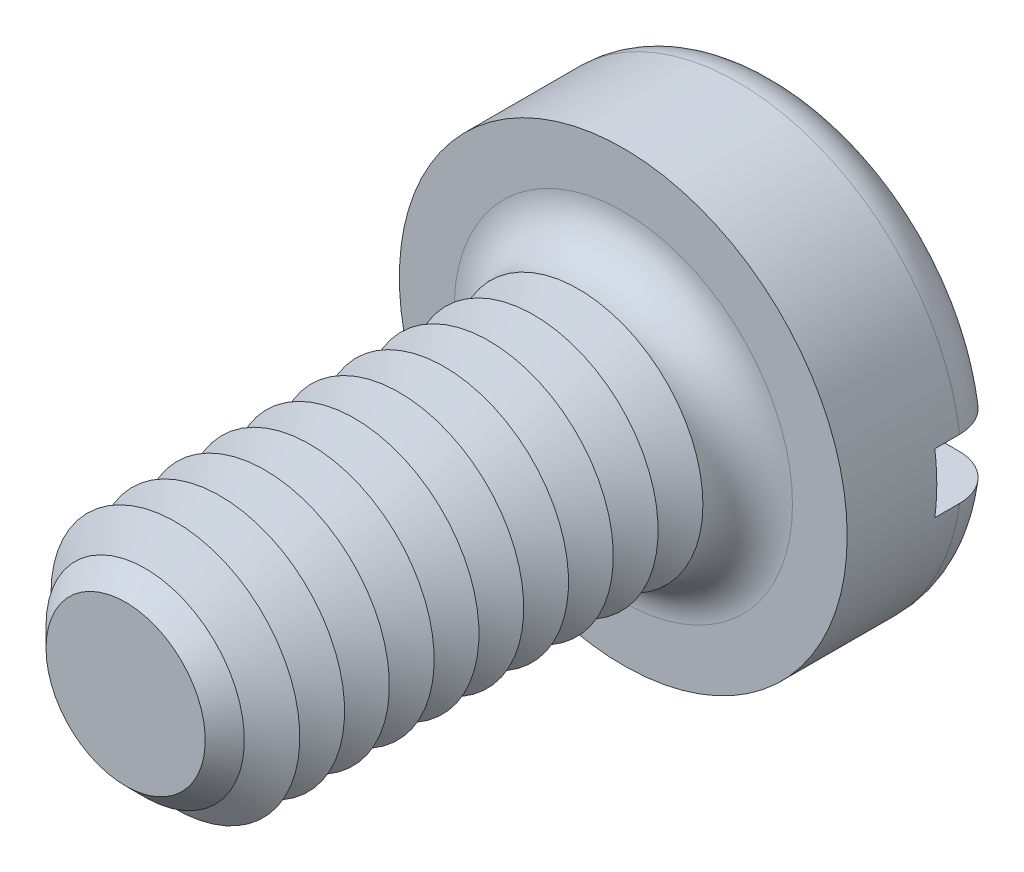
ISO-10303-21;
HEADER;
FILE_DESCRIPTION(('STEP AP214'),'2;1');
FILE_NAME('part.step','',(''),(''),'','','');
FILE_SCHEMA(('AUTOMOTIVE_DESIGN { 1 0 10303 214 1 1 1 1 }'));
ENDSEC;
DATA;
#1=APPLICATION_CONTEXT('core data for automotive mechanical design processes');
#2=APPLICATION_PROTOCOL_DEFINITION('international standard','automotive_design',2000,#1);
#3=PRODUCT_CONTEXT('',#1,'mechanical');
#4=PRODUCT('Part','Part','',(#3));
#5=PRODUCT_RELATED_PRODUCT_CATEGORY('part','',(#4));
#6=PRODUCT_DEFINITION_FORMATION('','',#4);
#7=PRODUCT_DEFINITION_CONTEXT('part definition',#1,'design');
#8=PRODUCT_DEFINITION('design','',#6,#7);
#9=PRODUCT_DEFINITION_SHAPE('','',#8);
#10=(LENGTH_UNIT() NAMED_UNIT(*) SI_UNIT(.MILLI.,.METRE.));
#11=(NAMED_UNIT(*) PLANE_ANGLE_UNIT() SI_UNIT($,.RADIAN.));
#12=(NAMED_UNIT(*) SI_UNIT($,.STERADIAN.) SOLID_ANGLE_UNIT());
#13=UNCERTAINTY_MEASURE_WITH_UNIT(LENGTH_MEASURE(1.E-05),#10,'distance_accuracy_value','');
#14=(GEOMETRIC_REPRESENTATION_CONTEXT(3) GLOBAL_UNCERTAINTY_ASSIGNED_CONTEXT((#13)) GLOBAL_UNIT_ASSIGNED_CONTEXT((#10,
#11,#12)) REPRESENTATION_CONTEXT('',''));
#15=CARTESIAN_POINT('',(0.,0.,0.));
#16=DIRECTION('',(0.,0.,1.));
#17=DIRECTION('',(1.,0.,0.));
#18=AXIS2_PLACEMENT_3D('',#15,#16,#17);
#19=CARTESIAN_POINT('',(0.,0.,-1.6));
#20=DIRECTION('',(0.,0.,1.));
#21=DIRECTION('',(1.,0.,0.));
#22=AXIS2_PLACEMENT_3D('',#19,#20,#21);
#23=PLANE('',#22);
#24=CARTESIAN_POINT('',(0.,0.,-1.6));
#25=DIRECTION('',(0.,0.,1.));
#26=DIRECTION('',(1.,0.,0.));
#27=AXIS2_PLACEMENT_3D('',#24,#25,#26);
#28=CIRCLE('',#27,1.8);
#29=CARTESIAN_POINT('',(-1.77482393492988,0.3,-1.6));
#30=VERTEX_POINT('',#29);
#31=CARTESIAN_POINT('',(1.77482393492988,0.3,-1.6));
#32=VERTEX_POINT('',#31);
#33=EDGE_CURVE('E116',#30,#32,#28,.F.);
#34=ORIENTED_EDGE('',*,*,#33,.T.);
#35=DIRECTION('',(1.,0.,0.));
#36=VECTOR('',#35,1.);
#37=CARTESIAN_POINT('',(-2.25,0.3,-1.6));
#38=LINE('',#37,#36);
#39=EDGE_CURVE('E111',#30,#32,#38,.T.);
#40=ORIENTED_EDGE('',*,*,#39,.F.);
#41=EDGE_LOOP('',(#34,#40));
#42=FACE_BOUND('',#41,.T.);
#43=ADVANCED_FACE('F39',(#42),#23,.F.);
#44=CARTESIAN_POINT('',(0.,0.,-1.15));
#45=DIRECTION('',(0.,0.,1.));
#46=DIRECTION('',(1.,0.,0.));
#47=AXIS2_PLACEMENT_3D('',#44,#45,#46);
#48=TOROIDAL_SURFACE('',#47,1.8,0.45);
#49=CARTESIAN_POINT('',(-2.09367249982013,0.3,-1.4713087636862));
#50=CARTESIAN_POINT('',(-2.07531034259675,0.3,-1.48912990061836));
#51=CARTESIAN_POINT('',(-2.05541605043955,0.3,-1.50540110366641));
#52=CARTESIAN_POINT('',(-2.01315405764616,0.3,-1.53437465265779));
#53=CARTESIAN_POINT('',(-1.99078310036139,0.3,-1.54707221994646));
#54=CARTESIAN_POINT('',(-1.94425163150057,0.3,-1.56853090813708));
#55=CARTESIAN_POINT('',(-1.92009286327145,0.3,-1.57729580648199));
#56=CARTESIAN_POINT('',(-1.8706617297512,0.3,-1.59068015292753));
#57=CARTESIAN_POINT('',(-1.84538964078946,0.3,-1.59530062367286));
#58=CARTESIAN_POINT('',(-1.7942134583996,0.3,-1.60031507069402));
#59=CARTESIAN_POINT('',(-1.76830582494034,0.3,-1.60067291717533));
#60=CARTESIAN_POINT('',(-1.71679040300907,0.3,-1.59707477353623));
#61=CARTESIAN_POINT('',(-1.69118264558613,0.3,-1.59311834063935));
#62=CARTESIAN_POINT('',(-1.64075792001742,0.3,-1.58095464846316));
#63=CARTESIAN_POINT('',(-1.61594989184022,0.3,-1.57271029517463));
#64=CARTESIAN_POINT('',(-1.56806655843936,0.3,-1.55217762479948));
#65=CARTESIAN_POINT('',(-1.54499130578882,0.3,-1.53988918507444));
#66=CARTESIAN_POINT('',(-1.50122413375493,0.3,-1.51158963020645));
#67=CARTESIAN_POINT('',(-1.48053389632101,0.3,-1.49557591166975));
#68=CARTESIAN_POINT('',(-1.44217532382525,0.3,-1.46026359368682));
#69=CARTESIAN_POINT('',(-1.42450683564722,0.3,-1.4409651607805));
#70=CARTESIAN_POINT('',(-1.39293961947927,0.3,-1.39986821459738));
#71=CARTESIAN_POINT('',(-1.37899788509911,0.3,-1.37810275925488));
#72=CARTESIAN_POINT('',(-1.35506190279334,0.3,-1.33249939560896));
#73=CARTESIAN_POINT('',(-1.34506709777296,0.3,-1.30866178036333));
#74=CARTESIAN_POINT('',(-1.3295415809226,0.3,-1.26015137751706));
#75=CARTESIAN_POINT('',(-1.32391771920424,0.3,-1.23550839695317));
#76=CARTESIAN_POINT('',(-1.31696995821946,0.3,-1.18562442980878));
#77=CARTESIAN_POINT('',(-1.31564552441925,0.3,-1.16038351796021));
#78=CARTESIAN_POINT('',(-1.31732714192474,0.3,-1.11049178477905));
#79=CARTESIAN_POINT('',(-1.32025766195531,0.3,-1.08583837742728));
#80=CARTESIAN_POINT('',(-1.3302124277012,0.3,-1.03737369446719));
#81=CARTESIAN_POINT('',(-1.33723664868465,0.3,-1.01356241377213));
#82=CARTESIAN_POINT('',(-1.35515820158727,0.3,-0.967413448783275));
#83=CARTESIAN_POINT('',(-1.36606032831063,0.3,-0.945077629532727));
#84=CARTESIAN_POINT('',(-1.39139351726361,0.3,-0.902507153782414));
#85=CARTESIAN_POINT('',(-1.40582489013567,0.3,-0.882272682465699));
#86=CARTESIAN_POINT('',(-1.43808691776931,0.3,-0.844072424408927));
#87=CARTESIAN_POINT('',(-1.4559757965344,0.3,-0.826155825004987));
#88=CARTESIAN_POINT('',(-1.49445205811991,0.3,-0.793502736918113));
#89=CARTESIAN_POINT('',(-1.51503974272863,0.3,-0.778766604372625));
#90=CARTESIAN_POINT('',(-1.55880475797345,0.3,-0.752571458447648));
#91=CARTESIAN_POINT('',(-1.58202794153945,0.3,-0.741189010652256));
#92=CARTESIAN_POINT('',(-1.63004083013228,0.3,-0.722432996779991));
#93=CARTESIAN_POINT('',(-1.65483064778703,0.3,-0.715059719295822));
#94=CARTESIAN_POINT('',(-1.70558060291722,0.3,-0.704463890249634));
#95=CARTESIAN_POINT('',(-1.73155090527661,0.3,-0.701289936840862));
#96=CARTESIAN_POINT('',(-1.78365633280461,0.3,-0.699350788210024));
#97=CARTESIAN_POINT('',(-1.80979145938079,0.3,-0.700585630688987));
#98=CARTESIAN_POINT('',(-1.86145503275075,0.3,-0.70744393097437));
#99=CARTESIAN_POINT('',(-1.88698403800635,0.3,-0.713063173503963));
#100=CARTESIAN_POINT('',(-1.93672112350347,0.3,-0.728546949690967));
#101=CARTESIAN_POINT('',(-1.96092925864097,0.3,-0.738411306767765));
#102=CARTESIAN_POINT('',(-2.00710191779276,0.3,-0.762015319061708));
#103=CARTESIAN_POINT('',(-2.02908465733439,0.3,-0.775719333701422));
#104=CARTESIAN_POINT('',(-2.0704025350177,0.3,-0.806663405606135));
#105=CARTESIAN_POINT('',(-2.08973782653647,0.3,-0.823903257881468));
#106=CARTESIAN_POINT('',(-2.12497879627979,0.3,-0.861218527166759));
#107=CARTESIAN_POINT('',(-2.1409209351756,0.3,-0.881259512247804));
#108=CARTESIAN_POINT('',(-2.16917502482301,0.3,-0.92375535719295));
#109=CARTESIAN_POINT('',(-2.18148717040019,0.3,-0.946210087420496));
#110=CARTESIAN_POINT('',(-2.20201023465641,0.3,-0.99266079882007));
#111=CARTESIAN_POINT('',(-2.21025973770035,0.3,-1.01663973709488));
#112=CARTESIAN_POINT('',(-2.22258852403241,0.3,-1.06564563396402));
#113=CARTESIAN_POINT('',(-2.22666813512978,0.3,-1.0906725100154));
#114=CARTESIAN_POINT('',(-2.23052418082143,0.3,-1.14090288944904));
#115=CARTESIAN_POINT('',(-2.23032644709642,0.3,-1.16610441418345));
#116=CARTESIAN_POINT('',(-2.22569614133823,0.3,-1.21612212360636));
#117=CARTESIAN_POINT('',(-2.2212625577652,0.3,-1.24093821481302));
#118=CARTESIAN_POINT('',(-2.20829785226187,0.3,-1.2894516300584));
#119=CARTESIAN_POINT('',(-2.19976997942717,0.3,-1.31314982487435));
#120=CARTESIAN_POINT('',(-2.17887390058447,0.3,-1.35876313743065));
#121=CARTESIAN_POINT('',(-2.1665103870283,0.3,-1.3806803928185));
#122=CARTESIAN_POINT('',(-2.14384463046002,0.3,-1.4140108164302));
#123=CARTESIAN_POINT('',(-2.13462949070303,0.3,-1.42617780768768));
#124=CARTESIAN_POINT('',(-2.1150151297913,0.3,-1.44951629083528));
#125=CARTESIAN_POINT('',(-2.10461591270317,0.3,-1.46068778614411));
#126=CARTESIAN_POINT('',(-2.09367249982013,0.3,-1.4713087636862));
#127=B_SPLINE_CURVE_WITH_KNOTS('',3,(#49,#50,#51,#52,#53,#54,#55,#56,#57,#58,#59,#60,#61,#62,
#63,#64,#65,#66,#67,#68,#69,#70,#71,#72,#73,#74,#75,#76,#77,#78,#79,#80,#81,#82,#83,#84,#85,#86,
#87,#88,#89,#90,#91,#92,#93,#94,#95,#96,#97,#98,#99,#100,#101,#102,#103,#104,#105,#106,#107,
#108,#109,#110,#111,#112,#113,#114,#115,#116,#117,#118,#119,#120,#121,#122,#123,#124,#125,#126),
.UNSPECIFIED.,.T.,.F.,(4,2,2,2,2,2,2,2,2,2,2,2,2,2,2,2,2,2,2,2,2,2,2,2,2,2,2,2,2,2,2,2,2,2,2,2,
2,2,4),(0.,0.0767085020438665,0.153519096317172,0.230255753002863,0.306973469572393,
0.384340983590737,0.461716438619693,0.539772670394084,0.617831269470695,0.695944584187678,
0.774053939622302,0.851218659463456,0.928372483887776,1.00383319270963,1.07928451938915,
1.15341274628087,1.22754052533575,1.30176027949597,1.37598656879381,1.45159320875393,
1.52720831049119,1.6044355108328,1.68166826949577,1.75978723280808,1.8379068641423,
1.91595148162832,1.99399285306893,2.07133254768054,2.14866775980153,2.22512456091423,
2.30157725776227,2.3772891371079,2.45299506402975,2.52824391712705,2.60351074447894,
2.67871794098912,2.75383349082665,2.79955010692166,2.84526656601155),.UNSPECIFIED.);
#128=CARTESIAN_POINT('',(-2.22991031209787,0.3,-1.14999999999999));
#129=VERTEX_POINT('',#128);
#130=EDGE_CURVE('E265',#129,#30,#127,.T.);
#131=ORIENTED_EDGE('',*,*,#130,.F.);
#132=CARTESIAN_POINT('',(0.,0.,-1.15));
#133=DIRECTION('',(0.,0.,1.));
#134=DIRECTION('',(1.,0.,0.));
#135=AXIS2_PLACEMENT_3D('',#132,#133,#134);
#136=CIRCLE('',#135,2.25);
#137=CARTESIAN_POINT('',(2.22991031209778,0.3,-1.15));
#138=VERTEX_POINT('',#137);
#139=EDGE_CURVE('E125',#138,#129,#136,.T.);
#140=ORIENTED_EDGE('',*,*,#139,.F.);
#141=CARTESIAN_POINT('',(1.39325818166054,0.3,-1.39903402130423));
#142=CARTESIAN_POINT('',(1.40771723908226,0.3,-1.42030595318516));
#143=CARTESIAN_POINT('',(1.4240122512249,0.3,-1.4403555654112));
#144=CARTESIAN_POINT('',(1.45976320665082,0.3,-1.4774406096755));
#145=CARTESIAN_POINT('',(1.47922380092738,0.3,-1.49447152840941));
#146=CARTESIAN_POINT('',(1.5206923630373,0.3,-1.52502510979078));
#147=CARTESIAN_POINT('',(1.54269721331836,0.3,-1.53855200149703));
#148=CARTESIAN_POINT('',(1.58863815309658,0.3,-1.56176272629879));
#149=CARTESIAN_POINT('',(1.61257369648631,0.3,-1.57144764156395));
#150=CARTESIAN_POINT('',(1.66199169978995,0.3,-1.58680804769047));
#151=CARTESIAN_POINT('',(1.68748839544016,0.3,-1.59243778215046));
#152=CARTESIAN_POINT('',(1.73906656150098,0.3,-1.59934902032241));
#153=CARTESIAN_POINT('',(1.76514807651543,0.3,-1.60063019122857));
#154=CARTESIAN_POINT('',(1.81721740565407,0.3,-1.59879130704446));
#155=CARTESIAN_POINT('',(1.84320486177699,0.3,-1.59566102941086));
#156=CARTESIAN_POINT('',(1.89427635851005,0.3,-1.58504931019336));
#157=CARTESIAN_POINT('',(1.91936042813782,0.3,-1.57756800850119));
#158=CARTESIAN_POINT('',(1.9677137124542,0.3,-1.55851722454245));
#159=CARTESIAN_POINT('',(1.99099484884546,0.3,-1.5469780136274));
#160=CARTESIAN_POINT('',(2.03525897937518,0.3,-1.52011224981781));
#161=CARTESIAN_POINT('',(2.05624211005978,0.3,-1.50478592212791));
#162=CARTESIAN_POINT('',(2.09506403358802,0.3,-1.47096472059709));
#163=CARTESIAN_POINT('',(2.11293536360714,0.3,-1.45250719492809));
#164=CARTESIAN_POINT('',(2.14528563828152,0.3,-1.41282609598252));
#165=CARTESIAN_POINT('',(2.15976477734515,0.3,-1.39160268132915));
#166=CARTESIAN_POINT('',(2.18476262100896,0.3,-1.34723254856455));
#167=CARTESIAN_POINT('',(2.19532119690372,0.3,-1.32410828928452));
#168=CARTESIAN_POINT('',(2.21237438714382,0.3,-1.27640693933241));
#169=CARTESIAN_POINT('',(2.21886918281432,0.3,-1.25182991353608));
#170=CARTESIAN_POINT('',(2.2275687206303,0.3,-1.20210937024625));
#171=CARTESIAN_POINT('',(2.22980376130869,0.3,-1.17697115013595));
#172=CARTESIAN_POINT('',(2.23000940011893,0.3,-1.12667754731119));
#173=CARTESIAN_POINT('',(2.22798009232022,0.3,-1.10152216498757));
#174=CARTESIAN_POINT('',(2.21972856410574,0.3,-1.05197773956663));
#175=CARTESIAN_POINT('',(2.21351744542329,0.3,-1.02758684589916));
#176=CARTESIAN_POINT('',(2.19709696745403,0.3,-0.980190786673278));
#177=CARTESIAN_POINT('',(2.18688760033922,0.3,-0.957185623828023));
#178=CARTESIAN_POINT('',(2.1627435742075,0.3,-0.913157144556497));
#179=CARTESIAN_POINT('',(2.14880093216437,0.3,-0.892138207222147));
#180=CARTESIAN_POINT('',(2.11760640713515,0.3,-0.852719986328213));
#181=CARTESIAN_POINT('',(2.10035443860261,0.3,-0.834320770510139));
#182=CARTESIAN_POINT('',(2.06291254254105,0.3,-0.80052923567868));
#183=CARTESIAN_POINT('',(2.04270386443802,0.3,-0.785157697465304));
#184=CARTESIAN_POINT('',(2.0000139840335,0.3,-0.757986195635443));
#185=CARTESIAN_POINT('',(1.97753267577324,0.3,-0.746186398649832));
#186=CARTESIAN_POINT('',(1.93069507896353,0.3,-0.726364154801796));
#187=CARTESIAN_POINT('',(1.90632219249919,0.3,-0.718380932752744));
#188=CARTESIAN_POINT('',(1.85658993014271,0.3,-0.706569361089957));
#189=CARTESIAN_POINT('',(1.83123049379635,0.3,-0.702741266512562));
#190=CARTESIAN_POINT('',(1.77994107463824,0.3,-0.699306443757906));
#191=CARTESIAN_POINT('',(1.75400788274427,0.3,-0.69974759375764));
#192=CARTESIAN_POINT('',(1.70257608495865,0.3,-0.704939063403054));
#193=CARTESIAN_POINT('',(1.67707750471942,0.3,-0.709689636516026));
#194=CARTESIAN_POINT('',(1.62701662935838,0.3,-0.723419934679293));
#195=CARTESIAN_POINT('',(1.60246387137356,0.3,-0.732434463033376));
#196=CARTESIAN_POINT('',(1.55521886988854,0.3,-0.754458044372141));
#197=CARTESIAN_POINT('',(1.53252668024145,0.3,-0.76746721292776));
#198=CARTESIAN_POINT('',(1.48966925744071,0.3,-0.797124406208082));
#199=CARTESIAN_POINT('',(1.46950315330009,0.3,-0.813771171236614));
#200=CARTESIAN_POINT('',(1.43229728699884,0.3,-0.850255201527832));
#201=CARTESIAN_POINT('',(1.41525734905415,0.3,-0.870092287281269));
#202=CARTESIAN_POINT('',(1.3850470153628,0.3,-0.912123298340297));
#203=CARTESIAN_POINT('',(1.37182821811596,0.3,-0.934282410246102));
#204=CARTESIAN_POINT('',(1.34939737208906,0.3,-0.980542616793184));
#205=CARTESIAN_POINT('',(1.34018456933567,0.3,-1.00464334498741));
#206=CARTESIAN_POINT('',(1.32624172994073,0.3,-1.05352472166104));
#207=CARTESIAN_POINT('',(1.32141599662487,0.3,-1.07827808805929));
#208=CARTESIAN_POINT('',(1.31606478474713,0.3,-1.12825155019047));
#209=CARTESIAN_POINT('',(1.31553992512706,0.3,-1.15347171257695));
#210=CARTESIAN_POINT('',(1.31878307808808,0.3,-1.20323022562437));
#211=CARTESIAN_POINT('',(1.32248353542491,0.3,-1.22777305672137));
#212=CARTESIAN_POINT('',(1.33394086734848,0.3,-1.27586981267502));
#213=CARTESIAN_POINT('',(1.34169274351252,0.3,-1.2994249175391));
#214=CARTESIAN_POINT('',(1.35704250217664,0.3,-1.33561898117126));
#215=CARTESIAN_POINT('',(1.36341395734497,0.3,-1.34879219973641));
#216=CARTESIAN_POINT('',(1.37741190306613,0.3,-1.37445328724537));
#217=CARTESIAN_POINT('',(1.38503837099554,0.3,-1.38694116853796));
#218=CARTESIAN_POINT('',(1.39325818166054,0.3,-1.39903402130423));
#219=B_SPLINE_CURVE_WITH_KNOTS('',3,(#141,#142,#143,#144,#145,#146,#147,#148,#149,#150,#151,
#152,#153,#154,#155,#156,#157,#158,#159,#160,#161,#162,#163,#164,#165,#166,#167,#168,#169,#170,
#171,#172,#173,#174,#175,#176,#177,#178,#179,#180,#181,#182,#183,#184,#185,#186,#187,#188,#189,
#190,#191,#192,#193,#194,#195,#196,#197,#198,#199,#200,#201,#202,#203,#204,#205,#206,#207,#208,
#209,#210,#211,#212,#213,#214,#215,#216,#217,#218),.UNSPECIFIED.,.T.,.F.,(4,2,2,2,2,2,2,2,2,2,2,
2,2,2,2,2,2,2,2,2,2,2,2,2,2,2,2,2,2,2,2,2,2,2,2,2,2,2,4),(0.,0.0771077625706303,
0.154329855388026,0.231458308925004,0.308565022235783,0.386528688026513,0.464498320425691,
0.542648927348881,0.620797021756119,0.698374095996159,0.77594655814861,0.852651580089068,
0.929352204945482,1.00524992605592,1.08114426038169,1.15649673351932,1.2318475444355,
1.30699910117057,1.38215080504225,1.45746451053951,1.53278016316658,1.60859599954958,
1.68441537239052,1.76099806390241,1.83758545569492,1.91503273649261,1.99248457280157,
2.07057979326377,2.14867727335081,2.22674775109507,2.30481383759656,2.38184276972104,
2.45885719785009,2.53414829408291,2.6094502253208,2.68356487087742,2.75758829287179,
2.80142397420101,2.84525886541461),.UNSPECIFIED.);
#220=EDGE_CURVE('E267',#32,#138,#219,.T.);
#221=ORIENTED_EDGE('',*,*,#220,.F.);
#222=ORIENTED_EDGE('',*,*,#33,.F.);
#223=EDGE_LOOP('',(#131,#140,#221,#222));
#224=FACE_BOUND('',#223,.T.);
#225=ADVANCED_FACE('F249',(#224),#48,.T.);
#226=CARTESIAN_POINT('',(0.,0.,-1.6));
#227=DIRECTION('',(0.,0.,1.));
#228=DIRECTION('',(1.,0.,0.));
#229=AXIS2_PLACEMENT_3D('',#226,#227,#228);
#230=CYLINDRICAL_SURFACE('',#229,2.25);
#231=DIRECTION('',(0.,0.,1.));
#232=VECTOR('',#231,1.);
#233=CARTESIAN_POINT('',(2.22991031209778,0.3,-1.6));
#234=LINE('',#233,#232);
#235=CARTESIAN_POINT('',(2.22991031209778,0.3,-0.9));
#236=VERTEX_POINT('',#235);
#237=EDGE_CURVE('E283',#138,#236,#234,.T.);
#238=ORIENTED_EDGE('',*,*,#237,.F.);
#239=ORIENTED_EDGE('',*,*,#139,.T.);
#240=DIRECTION('',(0.,0.,1.));
#241=VECTOR('',#240,1.);
#242=CARTESIAN_POINT('',(-2.22991031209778,0.3,-1.6));
#243=LINE('',#242,#241);
#244=CARTESIAN_POINT('',(-2.22991031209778,0.3,-0.9));
#245=VERTEX_POINT('',#244);
#246=EDGE_CURVE('E63',#245,#129,#243,.F.);
#247=ORIENTED_EDGE('',*,*,#246,.F.);
#248=CARTESIAN_POINT('',(0.,0.,-0.9));
#249=DIRECTION('',(0.,0.,-1.));
#250=DIRECTION('',(-1.,0.,0.));
#251=AXIS2_PLACEMENT_3D('',#248,#249,#250);
#252=CIRCLE('',#251,2.25);
#253=CARTESIAN_POINT('',(-2.22991031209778,-0.3,-0.9));
#254=VERTEX_POINT('',#253);
#255=EDGE_CURVE('E43',#245,#254,#252,.F.);
#256=ORIENTED_EDGE('',*,*,#255,.T.);
#257=DIRECTION('',(0.,0.,1.));
#258=VECTOR('',#257,1.);
#259=CARTESIAN_POINT('',(-2.22991031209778,-0.3,-1.6));
#260=LINE('',#259,#258);
#261=CARTESIAN_POINT('',(-2.22991031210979,-0.3,-1.15000000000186));
#262=VERTEX_POINT('',#261);
#263=EDGE_CURVE('E280',#262,#254,#260,.T.);
#264=ORIENTED_EDGE('',*,*,#263,.F.);
#265=CARTESIAN_POINT('',(2.22991031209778,-0.3,-1.15));
#266=VERTEX_POINT('',#265);
#267=EDGE_CURVE('E127',#262,#266,#136,.T.);
#268=ORIENTED_EDGE('',*,*,#267,.T.);
#269=DIRECTION('',(0.,0.,1.));
#270=VECTOR('',#269,1.);
#271=CARTESIAN_POINT('',(2.22991031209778,-0.3,-1.6));
#272=LINE('',#271,#270);
#273=CARTESIAN_POINT('',(2.22991031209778,-0.3,-0.9));
#274=VERTEX_POINT('',#273);
#275=EDGE_CURVE('E55',#274,#266,#272,.F.);
#276=ORIENTED_EDGE('',*,*,#275,.F.);
#277=EDGE_CURVE('E11',#274,#236,#252,.F.);
#278=ORIENTED_EDGE('',*,*,#277,.T.);
#279=EDGE_LOOP('',(#238,#239,#247,#256,#264,#268,#276,#278));
#280=FACE_BOUND('',#279,.T.);
#281=CARTESIAN_POINT('',(0.,0.,0.));
#282=DIRECTION('',(0.,0.,1.));
#283=DIRECTION('',(1.,0.,0.));
#284=AXIS2_PLACEMENT_3D('',#281,#282,#283);
#285=CIRCLE('',#284,2.25);
#286=CARTESIAN_POINT('',(2.25,0.,0.));
#287=VERTEX_POINT('',#286);
#288=EDGE_CURVE('E286',#287,#287,#285,.T.);
#289=ORIENTED_EDGE('',*,*,#288,.F.);
#290=EDGE_LOOP('',(#289));
#291=FACE_BOUND('',#290,.T.);
#292=ADVANCED_FACE('F245',(#280,#291),#230,.T.);
#293=CARTESIAN_POINT('',(1.77482393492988,-0.3,-1.6));
#294=VERTEX_POINT('',#293);
#295=CARTESIAN_POINT('',(-1.77482393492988,-0.3,-1.6));
#296=VERTEX_POINT('',#295);
#297=EDGE_CURVE('E109',#294,#296,#28,.F.);
#298=ORIENTED_EDGE('',*,*,#297,.T.);
#299=DIRECTION('',(-1.,0.,0.));
#300=VECTOR('',#299,1.);
#301=CARTESIAN_POINT('',(-2.25,-0.3,-1.6));
#302=LINE('',#301,#300);
#303=EDGE_CURVE('E96',#294,#296,#302,.T.);
#304=ORIENTED_EDGE('',*,*,#303,.F.);
#305=EDGE_LOOP('',(#298,#304));
#306=FACE_BOUND('',#305,.T.);
#307=ADVANCED_FACE('F108',(#306),#23,.F.);
#308=CARTESIAN_POINT('',(0.,0.,0.));
#309=DIRECTION('',(0.,0.,1.));
#310=DIRECTION('',(1.,0.,0.));
#311=AXIS2_PLACEMENT_3D('',#308,#309,#310);
#312=PLANE('',#311);
#313=CARTESIAN_POINT('',(0.,0.,0.));
#314=DIRECTION('',(0.,0.,1.));
#315=DIRECTION('',(1.,0.,0.));
#316=AXIS2_PLACEMENT_3D('',#313,#314,#315);
#317=CIRCLE('',#316,1.7);
#318=CARTESIAN_POINT('',(1.7,0.,0.));
#319=VERTEX_POINT('',#318);
#320=EDGE_CURVE('E115',#319,#319,#317,.F.);
#321=ORIENTED_EDGE('',*,*,#320,.T.);
#322=EDGE_LOOP('',(#321));
#323=FACE_BOUND('',#322,.T.);
#324=ORIENTED_EDGE('',*,*,#288,.T.);
#325=EDGE_LOOP('',(#324));
#326=FACE_BOUND('',#325,.T.);
#327=ADVANCED_FACE('F244',(#323,#326),#312,.T.);
#328=CARTESIAN_POINT('',(-2.09367249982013,-0.3,-1.4713087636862));
#329=CARTESIAN_POINT('',(-2.11176539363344,-0.3,-1.45374579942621));
#330=CARTESIAN_POINT('',(-2.1283968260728,-0.3,-1.43465254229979));
#331=CARTESIAN_POINT('',(-2.15823692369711,-0.3,-1.39393307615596));
#332=CARTESIAN_POINT('',(-2.17144184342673,-0.3,-1.37230413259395));
#333=CARTESIAN_POINT('',(-2.19402281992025,-0.3,-1.32713362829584));
#334=CARTESIAN_POINT('',(-2.20339951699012,-0.3,-1.30359238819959));
#335=CARTESIAN_POINT('',(-2.21804409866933,-0.3,-1.25527081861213));
#336=CARTESIAN_POINT('',(-2.22331295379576,-0.3,-1.23049078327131));
#337=CARTESIAN_POINT('',(-2.22957448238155,-0.3,-1.18050893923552));
#338=CARTESIAN_POINT('',(-2.23058617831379,-0.3,-1.15530951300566));
#339=CARTESIAN_POINT('',(-2.22835535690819,-0.3,-1.10509920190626));
#340=CARTESIAN_POINT('',(-2.22511277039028,-0.3,-1.08008832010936));
#341=CARTESIAN_POINT('',(-2.21448018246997,-0.3,-1.03101646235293));
#342=CARTESIAN_POINT('',(-2.20709836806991,-0.3,-1.00695371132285));
#343=CARTESIAN_POINT('',(-2.18841075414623,-0.3,-0.960404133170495));
#344=CARTESIAN_POINT('',(-2.17710493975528,-0.3,-0.937917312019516));
#345=CARTESIAN_POINT('',(-2.15086234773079,-0.3,-0.895085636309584));
#346=CARTESIAN_POINT('',(-2.13591537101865,-0.3,-0.874747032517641));
#347=CARTESIAN_POINT('',(-2.1028415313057,-0.3,-0.836845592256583));
#348=CARTESIAN_POINT('',(-2.08471458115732,-0.3,-0.819282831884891));
#349=CARTESIAN_POINT('',(-2.0456590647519,-0.3,-0.78729174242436));
#350=CARTESIAN_POINT('',(-2.0247112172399,-0.3,-0.772886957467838));
#351=CARTESIAN_POINT('',(-1.98071452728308,-0.3,-0.747756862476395));
#352=CARTESIAN_POINT('',(-1.95766557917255,-0.3,-0.737031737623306));
#353=CARTESIAN_POINT('',(-1.90986554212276,-0.3,-0.71944451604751));
#354=CARTESIAN_POINT('',(-1.88509923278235,-0.3,-0.712623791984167));
#355=CARTESIAN_POINT('',(-1.83477837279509,-0.3,-0.703186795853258));
#356=CARTESIAN_POINT('',(-1.80922377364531,-0.3,-0.700570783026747));
#357=CARTESIAN_POINT('',(-1.75774893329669,-0.3,-0.699591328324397));
#358=CARTESIAN_POINT('',(-1.73182778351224,-0.3,-0.701275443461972));
#359=CARTESIAN_POINT('',(-1.68062744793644,-0.3,-0.708937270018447));
#360=CARTESIAN_POINT('',(-1.65534829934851,-0.3,-0.714915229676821));
#361=CARTESIAN_POINT('',(-1.6059539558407,-0.3,-0.731056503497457));
#362=CARTESIAN_POINT('',(-1.58184881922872,-0.3,-0.741250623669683));
#363=CARTESIAN_POINT('',(-1.53569497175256,-0.3,-0.765548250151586));
#364=CARTESIAN_POINT('',(-1.51364629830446,-0.3,-0.779651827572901));
#365=CARTESIAN_POINT('',(-1.47229470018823,-0.3,-0.811355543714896));
#366=CARTESIAN_POINT('',(-1.45298625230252,-0.3,-0.828948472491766));
#367=CARTESIAN_POINT('',(-1.41765142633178,-0.3,-0.867170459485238));
#368=CARTESIAN_POINT('',(-1.40162480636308,-0.3,-0.887799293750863));
#369=CARTESIAN_POINT('',(-1.37358365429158,-0.3,-0.93118317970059));
#370=CARTESIAN_POINT('',(-1.3615121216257,-0.3,-0.953901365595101));
#371=CARTESIAN_POINT('',(-1.34145576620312,-0.3,-1.00107529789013));
#372=CARTESIAN_POINT('',(-1.33347032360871,-0.3,-1.02553078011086));
#373=CARTESIAN_POINT('',(-1.32199536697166,-0.3,-1.07489401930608));
#374=CARTESIAN_POINT('',(-1.31840873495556,-0.3,-1.09977921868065));
#375=CARTESIAN_POINT('',(-1.31553052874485,-0.3,-1.1497957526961));
#376=CARTESIAN_POINT('',(-1.31623852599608,-0.3,-1.17492706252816));
#377=CARTESIAN_POINT('',(-1.32188368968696,-0.3,-1.22435119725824));
#378=CARTESIAN_POINT('',(-1.32676151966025,-0.3,-1.24865083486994));
#379=CARTESIAN_POINT('',(-1.34050334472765,-0.3,-1.29609421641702));
#380=CARTESIAN_POINT('',(-1.34936742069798,-0.3,-1.31923793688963));
#381=CARTESIAN_POINT('',(-1.37086295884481,-0.3,-1.36387796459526));
#382=CARTESIAN_POINT('',(-1.38351729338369,-0.3,-1.38536324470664));
#383=CARTESIAN_POINT('',(-1.41218367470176,-0.3,-1.42596199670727));
#384=CARTESIAN_POINT('',(-1.42819606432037,-0.3,-1.44507522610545));
#385=CARTESIAN_POINT('',(-1.46347664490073,-0.3,-1.48081087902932));
#386=CARTESIAN_POINT('',(-1.48280543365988,-0.3,-1.49737347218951));
#387=CARTESIAN_POINT('',(-1.5239232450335,-0.3,-1.52709508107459));
#388=CARTESIAN_POINT('',(-1.54571253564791,-0.3,-1.54025372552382));
#389=CARTESIAN_POINT('',(-1.59160097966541,-0.3,-1.56305446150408));
#390=CARTESIAN_POINT('',(-1.61573734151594,-0.3,-1.57262172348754));
#391=CARTESIAN_POINT('',(-1.66526504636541,-0.3,-1.58760700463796));
#392=CARTESIAN_POINT('',(-1.69065641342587,-0.3,-1.59302494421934));
#393=CARTESIAN_POINT('',(-1.74220154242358,-0.3,-1.59958446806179));
#394=CARTESIAN_POINT('',(-1.7683598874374,-0.3,-1.60069012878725));
#395=CARTESIAN_POINT('',(-1.82049681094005,-0.3,-1.59847888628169));
#396=CARTESIAN_POINT('',(-1.8464753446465,-0.3,-1.59516091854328));
#397=CARTESIAN_POINT('',(-1.89742078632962,-0.3,-1.58419269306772));
#398=CARTESIAN_POINT('',(-1.92239041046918,-0.3,-1.57655503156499));
#399=CARTESIAN_POINT('',(-1.97064988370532,-0.3,-1.55715679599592));
#400=CARTESIAN_POINT('',(-1.99394179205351,-0.3,-1.54540138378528));
#401=CARTESIAN_POINT('',(-2.03003215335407,-0.3,-1.52312594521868));
#402=CARTESIAN_POINT('',(-2.04354254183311,-0.3,-1.51373809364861));
#403=CARTESIAN_POINT('',(-2.06946640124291,-0.3,-1.49355310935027));
#404=CARTESIAN_POINT('',(-2.08187987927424,-0.3,-1.48275598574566));
#405=CARTESIAN_POINT('',(-2.09367249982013,-0.3,-1.4713087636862));
#406=B_SPLINE_CURVE_WITH_KNOTS('',3,(#328,#329,#330,#331,#332,#333,#334,#335,#336,#337,#338,
#339,#340,#341,#342,#343,#344,#345,#346,#347,#348,#349,#350,#351,#352,#353,#354,#355,#356,#357,
#358,#359,#360,#361,#362,#363,#364,#365,#366,#367,#368,#369,#370,#371,#372,#373,#374,#375,#376,
#377,#378,#379,#380,#381,#382,#383,#384,#385,#386,#387,#388,#389,#390,#391,#392,#393,#394,#395,
#396,#397,#398,#399,#400,#401,#402,#403,#404,#405),.UNSPECIFIED.,.T.,.F.,(4,2,2,2,2,2,2,2,2,2,2,
2,2,2,2,2,2,2,2,2,2,2,2,2,2,2,2,2,2,2,2,2,2,2,2,2,2,2,4),(0.,0.0755864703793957,
0.151255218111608,0.226911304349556,0.302549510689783,0.377849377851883,0.453150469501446,
0.528303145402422,0.603456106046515,0.67882204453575,0.754190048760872,0.83010216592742,
0.906018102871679,0.982724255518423,1.05943513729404,1.13699806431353,1.21456547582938,
1.29270994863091,1.37085584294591,1.44884191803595,1.52682224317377,1.60362346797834,
1.68041303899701,1.75547480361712,1.83052907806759,1.90453278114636,1.97853798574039,
2.05299909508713,2.12746781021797,2.20347986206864,2.27950020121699,2.3570265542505,
2.43455439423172,2.5127267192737,2.59091785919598,2.66888216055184,2.74674907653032,
2.79601528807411,2.84528118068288),.UNSPECIFIED.);
#407=EDGE_CURVE('E103',#296,#262,#406,.T.);
#408=ORIENTED_EDGE('',*,*,#407,.F.);
#409=ORIENTED_EDGE('',*,*,#297,.F.);
#410=CARTESIAN_POINT('',(1.39325818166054,-0.3,-1.39903402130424));
#411=CARTESIAN_POINT('',(1.37924349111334,-0.3,-1.37841200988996));
#412=CARTESIAN_POINT('',(1.36693374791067,-0.3,-1.35661225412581));
#413=CARTESIAN_POINT('',(1.34612289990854,-0.3,-1.31124547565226));
#414=CARTESIAN_POINT('',(1.33762533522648,-0.3,-1.28767683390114));
#415=CARTESIAN_POINT('',(1.32472877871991,-0.3,-1.23943261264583));
#416=CARTESIAN_POINT('',(1.3203309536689,-0.3,-1.21475672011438));
#417=CARTESIAN_POINT('',(1.31579198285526,-0.3,-1.16502199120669));
#418=CARTESIAN_POINT('',(1.31564980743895,-0.3,-1.13996324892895));
#419=CARTESIAN_POINT('',(1.31960322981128,-0.3,-1.09044336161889));
#420=CARTESIAN_POINT('',(1.32365524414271,-0.3,-1.06597872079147));
#421=CARTESIAN_POINT('',(1.33579339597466,-0.3,-1.01807218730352));
#422=CARTESIAN_POINT('',(1.34387971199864,-0.3,-0.994630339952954));
#423=CARTESIAN_POINT('',(1.36386460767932,-0.3,-0.949319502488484));
#424=CARTESIAN_POINT('',(1.37577869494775,-0.3,-0.92745736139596));
#425=CARTESIAN_POINT('',(1.40303929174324,-0.3,-0.885990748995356));
#426=CARTESIAN_POINT('',(1.41838612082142,-0.3,-0.866386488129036));
#427=CARTESIAN_POINT('',(1.45239955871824,-0.3,-0.829572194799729));
#428=CARTESIAN_POINT('',(1.47112624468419,-0.3,-0.812417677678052));
#429=CARTESIAN_POINT('',(1.51114353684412,-0.3,-0.78141873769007));
#430=CARTESIAN_POINT('',(1.53243442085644,-0.3,-0.767574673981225));
#431=CARTESIAN_POINT('',(1.57744959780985,-0.3,-0.743302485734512));
#432=CARTESIAN_POINT('',(1.6012148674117,-0.3,-0.732950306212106));
#433=CARTESIAN_POINT('',(1.65013556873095,-0.3,-0.71633816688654));
#434=CARTESIAN_POINT('',(1.67529109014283,-0.3,-0.710078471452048));
#435=CARTESIAN_POINT('',(1.72654223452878,-0.3,-0.701786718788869));
#436=CARTESIAN_POINT('',(1.75264462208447,-0.3,-0.699796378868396));
#437=CARTESIAN_POINT('',(1.80481283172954,-0.3,-0.700236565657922));
#438=CARTESIAN_POINT('',(1.83087865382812,-0.3,-0.702667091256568));
#439=CARTESIAN_POINT('',(1.88216421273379,-0.3,-0.71188843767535));
#440=CARTESIAN_POINT('',(1.90738581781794,-0.3,-0.718668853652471));
#441=CARTESIAN_POINT('',(1.95631449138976,-0.3,-0.736408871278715));
#442=CARTESIAN_POINT('',(1.98002162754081,-0.3,-0.747368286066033));
#443=CARTESIAN_POINT('',(2.02500221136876,-0.3,-0.773046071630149));
#444=CARTESIAN_POINT('',(2.04629687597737,-0.3,-0.78772726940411));
#445=CARTESIAN_POINT('',(2.08608258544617,-0.3,-0.820494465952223));
#446=CARTESIAN_POINT('',(2.10457379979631,-0.3,-0.838580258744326));
#447=CARTESIAN_POINT('',(2.1380062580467,-0.3,-0.877422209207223));
#448=CARTESIAN_POINT('',(2.15298532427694,-0.3,-0.898145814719));
#449=CARTESIAN_POINT('',(2.17921311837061,-0.3,-0.941832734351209));
#450=CARTESIAN_POINT('',(2.19046204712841,-0.3,-0.964795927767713));
#451=CARTESIAN_POINT('',(2.20880507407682,-0.3,-1.01207981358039));
#452=CARTESIAN_POINT('',(2.2159367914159,-0.3,-1.0363859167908));
#453=CARTESIAN_POINT('',(2.22599386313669,-0.3,-1.08585317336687));
#454=CARTESIAN_POINT('',(2.22891936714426,-0.3,-1.11101429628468));
#455=CARTESIAN_POINT('',(2.23047255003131,-0.3,-1.16133395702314));
#456=CARTESIAN_POINT('',(2.22912306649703,-0.3,-1.18649179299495));
#457=CARTESIAN_POINT('',(2.22221641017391,-0.3,-1.236222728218));
#458=CARTESIAN_POINT('',(2.21665928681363,-0.3,-1.26079583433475));
#459=CARTESIAN_POINT('',(2.20150655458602,-0.3,-1.30864604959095));
#460=CARTESIAN_POINT('',(2.19191347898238,-0.3,-1.3319239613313));
#461=CARTESIAN_POINT('',(2.16897085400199,-0.3,-1.37654778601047));
#462=CARTESIAN_POINT('',(2.15562126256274,-0.3,-1.39789367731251));
#463=CARTESIAN_POINT('',(2.12549147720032,-0.3,-1.43814583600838));
#464=CARTESIAN_POINT('',(2.1086973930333,-0.3,-1.45704170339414));
#465=CARTESIAN_POINT('',(2.07219852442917,-0.3,-1.491773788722));
#466=CARTESIAN_POINT('',(2.0524936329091,-0.3,-1.50760989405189));
#467=CARTESIAN_POINT('',(2.01056127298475,-0.3,-1.53591667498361));
#468=CARTESIAN_POINT('',(1.98831430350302,-0.3,-1.54835845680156));
#469=CARTESIAN_POINT('',(1.94206418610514,-0.3,-1.5693763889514));
#470=CARTESIAN_POINT('',(1.91806093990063,-0.3,-1.57795232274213));
#471=CARTESIAN_POINT('',(1.86869953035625,-0.3,-1.5910955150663));
#472=CARTESIAN_POINT('',(1.84332941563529,-0.3,-1.59561788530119));
#473=CARTESIAN_POINT('',(1.7921914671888,-0.3,-1.60038767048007));
#474=CARTESIAN_POINT('',(1.76642362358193,-0.3,-1.60063497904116));
#475=CARTESIAN_POINT('',(1.71493241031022,-0.3,-1.59684388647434));
#476=CARTESIAN_POINT('',(1.6892123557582,-0.3,-1.59276040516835));
#477=CARTESIAN_POINT('',(1.63880694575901,-0.3,-1.58035661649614));
#478=CARTESIAN_POINT('',(1.61412189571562,-0.3,-1.5720350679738));
#479=CARTESIAN_POINT('',(1.56635013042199,-0.3,-1.55132424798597));
#480=CARTESIAN_POINT('',(1.54327365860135,-0.3,-1.53891136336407));
#481=CARTESIAN_POINT('',(1.49956705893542,-0.3,-1.51037484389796));
#482=CARTESIAN_POINT('',(1.478934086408,-0.3,-1.49425558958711));
#483=CARTESIAN_POINT('',(1.44732882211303,-0.3,-1.46489751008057));
#484=CARTESIAN_POINT('',(1.43548118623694,-0.3,-1.45258668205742));
#485=CARTESIAN_POINT('',(1.41324217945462,-0.3,-1.42671249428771));
#486=CARTESIAN_POINT('',(1.40285079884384,-0.3,-1.41314914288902));
#487=CARTESIAN_POINT('',(1.39325818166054,-0.3,-1.39903402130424));
#488=B_SPLINE_CURVE_WITH_KNOTS('',3,(#410,#411,#412,#413,#414,#415,#416,#417,#418,#419,#420,
#421,#422,#423,#424,#425,#426,#427,#428,#429,#430,#431,#432,#433,#434,#435,#436,#437,#438,#439,
#440,#441,#442,#443,#444,#445,#446,#447,#448,#449,#450,#451,#452,#453,#454,#455,#456,#457,#458,
#459,#460,#461,#462,#463,#464,#465,#466,#467,#468,#469,#470,#471,#472,#473,#474,#475,#476,#477,
#478,#479,#480,#481,#482,#483,#484,#485,#486,#487),.UNSPECIFIED.,.T.,.F.,(4,2,2,2,2,2,2,2,2,2,2,
2,2,2,2,2,2,2,2,2,2,2,2,2,2,2,2,2,2,2,2,2,2,2,2,2,2,2,4),(0.,0.0747398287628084,
0.149548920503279,0.224379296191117,0.29919156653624,0.373234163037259,0.447280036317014,
0.521629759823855,0.595986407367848,0.671825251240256,0.747672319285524,0.825076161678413,
0.902485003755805,0.980646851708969,1.05880868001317,1.13678424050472,1.21475631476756,
1.29197834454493,1.36919570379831,1.44553881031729,1.52187780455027,1.59750777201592,
1.67313504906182,1.74835899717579,1.82358206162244,1.89875798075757,1.97393474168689,
2.04942084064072,2.12490971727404,2.20102244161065,2.27713942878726,2.35408926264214,
2.43104101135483,2.50880170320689,2.58658518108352,2.66482568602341,2.74297419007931,
2.79413160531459,2.84528867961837),.UNSPECIFIED.);
#489=EDGE_CURVE('E92',#266,#294,#488,.T.);
#490=ORIENTED_EDGE('',*,*,#489,.F.);
#491=ORIENTED_EDGE('',*,*,#267,.F.);
#492=EDGE_LOOP('',(#408,#409,#490,#491));
#493=FACE_BOUND('',#492,.T.);
#494=ADVANCED_FACE('F113',(#493),#48,.T.);
#495=CARTESIAN_POINT('',(0.,0.,0.45));
#496=DIRECTION('',(0.,0.,1.));
#497=DIRECTION('',(1.,0.,0.));
#498=AXIS2_PLACEMENT_3D('',#495,#496,#497);
#499=TOROIDAL_SURFACE('',#498,1.7,0.45);
#500=ORIENTED_EDGE('',*,*,#320,.F.);
#501=EDGE_LOOP('',(#500));
#502=FACE_BOUND('',#501,.T.);
#503=CARTESIAN_POINT('',(0.,0.,0.45));
#504=DIRECTION('',(0.,0.,-1.));
#505=DIRECTION('',(-1.,0.,0.));
#506=AXIS2_PLACEMENT_3D('',#503,#504,#505);
#507=CIRCLE('',#506,1.25);
#508=CARTESIAN_POINT('',(-1.25,0.,0.45));
#509=VERTEX_POINT('',#508);
#510=EDGE_CURVE('E292',#509,#509,#507,.T.);
#511=ORIENTED_EDGE('',*,*,#510,.T.);
#512=EDGE_LOOP('',(#511));
#513=FACE_BOUND('',#512,.T.);
#514=ADVANCED_FACE('F237',(#502,#513),#499,.F.);
#515=CARTESIAN_POINT('',(0.,0.,0.675));
#516=DIRECTION('',(0.,0.,-1.));
#517=DIRECTION('',(-1.,0.,0.));
#518=AXIS2_PLACEMENT_3D('',#515,#516,#517);
#519=CONICAL_SURFACE('',#518,0.860288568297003,1.0471975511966);
#520=ORIENTED_EDGE('',*,*,#510,.F.);
#521=EDGE_LOOP('',(#520));
#522=FACE_BOUND('',#521,.T.);
#523=CARTESIAN_POINT('',(0.,0.,0.675));
#524=DIRECTION('',(0.,0.,-1.));
#525=DIRECTION('',(-1.,0.,0.));
#526=AXIS2_PLACEMENT_3D('',#523,#524,#525);
#527=CIRCLE('',#526,0.860288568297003);
#528=CARTESIAN_POINT('',(-0.860288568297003,0.,0.675));
#529=VERTEX_POINT('',#528);
#530=EDGE_CURVE('E297',#529,#529,#527,.T.);
#531=ORIENTED_EDGE('',*,*,#530,.T.);
#532=EDGE_LOOP('',(#531));
#533=FACE_BOUND('',#532,.T.);
#534=ADVANCED_FACE('F233',(#522,#533),#519,.T.);
#535=CARTESIAN_POINT('',(0.,0.,0.9));
#536=DIRECTION('',(0.,0.,1.));
#537=DIRECTION('',(1.,0.,0.));
#538=AXIS2_PLACEMENT_3D('',#535,#536,#537);
#539=CONICAL_SURFACE('',#538,1.25,1.0471975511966);
#540=ORIENTED_EDGE('',*,*,#530,.F.);
#541=EDGE_LOOP('',(#540));
#542=FACE_BOUND('',#541,.T.);
#543=CARTESIAN_POINT('',(0.,0.,0.9));
#544=DIRECTION('',(0.,0.,-1.));
#545=DIRECTION('',(-1.,0.,0.));
#546=AXIS2_PLACEMENT_3D('',#543,#544,#545);
#547=CIRCLE('',#546,1.25);
#548=CARTESIAN_POINT('',(-1.25,0.,0.9));
#549=VERTEX_POINT('',#548);
#550=EDGE_CURVE('E303',#549,#549,#547,.T.);
#551=ORIENTED_EDGE('',*,*,#550,.T.);
#552=EDGE_LOOP('',(#551));
#553=FACE_BOUND('',#552,.T.);
#554=ADVANCED_FACE('F229',(#542,#553),#539,.T.);
#555=CARTESIAN_POINT('',(0.,0.,1.125));
#556=DIRECTION('',(0.,0.,-1.));
#557=DIRECTION('',(-1.,0.,0.));
#558=AXIS2_PLACEMENT_3D('',#555,#556,#557);
#559=CONICAL_SURFACE('',#558,0.860288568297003,1.0471975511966);
#560=ORIENTED_EDGE('',*,*,#550,.F.);
#561=EDGE_LOOP('',(#560));
#562=FACE_BOUND('',#561,.T.);
#563=CARTESIAN_POINT('',(0.,0.,1.125));
#564=DIRECTION('',(0.,0.,-1.));
#565=DIRECTION('',(-1.,0.,0.));
#566=AXIS2_PLACEMENT_3D('',#563,#564,#565);
#567=CIRCLE('',#566,0.860288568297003);
#568=CARTESIAN_POINT('',(-0.860288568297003,0.,1.125));
#569=VERTEX_POINT('',#568);
#570=EDGE_CURVE('E307',#569,#569,#567,.T.);
#571=ORIENTED_EDGE('',*,*,#570,.T.);
#572=EDGE_LOOP('',(#571));
#573=FACE_BOUND('',#572,.T.);
#574=ADVANCED_FACE('F225',(#562,#573),#559,.T.);
#575=CARTESIAN_POINT('',(0.,0.,1.35));
#576=DIRECTION('',(0.,0.,1.));
#577=DIRECTION('',(1.,0.,0.));
#578=AXIS2_PLACEMENT_3D('',#575,#576,#577);
#579=CONICAL_SURFACE('',#578,1.25,1.0471975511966);
#580=ORIENTED_EDGE('',*,*,#570,.F.);
#581=EDGE_LOOP('',(#580));
#582=FACE_BOUND('',#581,.T.);
#583=CARTESIAN_POINT('',(0.,0.,1.35));
#584=DIRECTION('',(0.,0.,-1.));
#585=DIRECTION('',(-1.,0.,0.));
#586=AXIS2_PLACEMENT_3D('',#583,#584,#585);
#587=CIRCLE('',#586,1.25);
#588=CARTESIAN_POINT('',(-1.25,0.,1.35));
#589=VERTEX_POINT('',#588);
#590=EDGE_CURVE('E311',#589,#589,#587,.T.);
#591=ORIENTED_EDGE('',*,*,#590,.T.);
#592=EDGE_LOOP('',(#591));
#593=FACE_BOUND('',#592,.T.);
#594=ADVANCED_FACE('F221',(#582,#593),#579,.T.);
#595=CARTESIAN_POINT('',(0.,0.,1.575));
#596=DIRECTION('',(0.,0.,-1.));
#597=DIRECTION('',(-1.,0.,0.));
#598=AXIS2_PLACEMENT_3D('',#595,#596,#597);
#599=CONICAL_SURFACE('',#598,0.860288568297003,1.0471975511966);
#600=ORIENTED_EDGE('',*,*,#590,.F.);
#601=EDGE_LOOP('',(#600));
#602=FACE_BOUND('',#601,.T.);
#603=CARTESIAN_POINT('',(0.,0.,1.575));
#604=DIRECTION('',(0.,0.,-1.));
#605=DIRECTION('',(-1.,0.,0.));
#606=AXIS2_PLACEMENT_3D('',#603,#604,#605);
#607=CIRCLE('',#606,0.860288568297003);
#608=CARTESIAN_POINT('',(-0.860288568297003,0.,1.575));
#609=VERTEX_POINT('',#608);
#610=EDGE_CURVE('E315',#609,#609,#607,.T.);
#611=ORIENTED_EDGE('',*,*,#610,.T.);
#612=EDGE_LOOP('',(#611));
#613=FACE_BOUND('',#612,.T.);
#614=ADVANCED_FACE('F217',(#602,#613),#599,.T.);
#615=CARTESIAN_POINT('',(0.,0.,1.8));
#616=DIRECTION('',(0.,0.,1.));
#617=DIRECTION('',(1.,0.,0.));
#618=AXIS2_PLACEMENT_3D('',#615,#616,#617);
#619=CONICAL_SURFACE('',#618,1.25,1.0471975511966);
#620=ORIENTED_EDGE('',*,*,#610,.F.);
#621=EDGE_LOOP('',(#620));
#622=FACE_BOUND('',#621,.T.);
#623=CARTESIAN_POINT('',(0.,0.,1.8));
#624=DIRECTION('',(0.,0.,-1.));
#625=DIRECTION('',(-1.,0.,0.));
#626=AXIS2_PLACEMENT_3D('',#623,#624,#625);
#627=CIRCLE('',#626,1.25);
#628=CARTESIAN_POINT('',(-1.25,0.,1.8));
#629=VERTEX_POINT('',#628);
#630=EDGE_CURVE('E318',#629,#629,#627,.T.);
#631=ORIENTED_EDGE('',*,*,#630,.T.);
#632=EDGE_LOOP('',(#631));
#633=FACE_BOUND('',#632,.T.);
#634=ADVANCED_FACE('F213',(#622,#633),#619,.T.);
#635=CARTESIAN_POINT('',(0.,0.,2.025));
#636=DIRECTION('',(0.,0.,-1.));
#637=DIRECTION('',(-1.,0.,0.));
#638=AXIS2_PLACEMENT_3D('',#635,#636,#637);
#639=CONICAL_SURFACE('',#638,0.860288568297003,1.0471975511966);
#640=ORIENTED_EDGE('',*,*,#630,.F.);
#641=EDGE_LOOP('',(#640));
#642=FACE_BOUND('',#641,.T.);
#643=CARTESIAN_POINT('',(0.,0.,2.025));
#644=DIRECTION('',(0.,0.,-1.));
#645=DIRECTION('',(-1.,0.,0.));
#646=AXIS2_PLACEMENT_3D('',#643,#644,#645);
#647=CIRCLE('',#646,0.860288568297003);
#648=CARTESIAN_POINT('',(-0.860288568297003,0.,2.025));
#649=VERTEX_POINT('',#648);
#650=EDGE_CURVE('E322',#649,#649,#647,.T.);
#651=ORIENTED_EDGE('',*,*,#650,.T.);
#652=EDGE_LOOP('',(#651));
#653=FACE_BOUND('',#652,.T.);
#654=ADVANCED_FACE('F209',(#642,#653),#639,.T.);
#655=CARTESIAN_POINT('',(0.,0.,2.25));
#656=DIRECTION('',(0.,0.,1.));
#657=DIRECTION('',(1.,0.,0.));
#658=AXIS2_PLACEMENT_3D('',#655,#656,#657);
#659=CONICAL_SURFACE('',#658,1.25,1.0471975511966);
#660=ORIENTED_EDGE('',*,*,#650,.F.);
#661=EDGE_LOOP('',(#660));
#662=FACE_BOUND('',#661,.T.);
#663=CARTESIAN_POINT('',(0.,0.,2.25));
#664=DIRECTION('',(0.,0.,-1.));
#665=DIRECTION('',(-1.,0.,0.));
#666=AXIS2_PLACEMENT_3D('',#663,#664,#665);
#667=CIRCLE('',#666,1.25);
#668=CARTESIAN_POINT('',(-1.25,0.,2.25));
#669=VERTEX_POINT('',#668);
#670=EDGE_CURVE('E326',#669,#669,#667,.T.);
#671=ORIENTED_EDGE('',*,*,#670,.T.);
#672=EDGE_LOOP('',(#671));
#673=FACE_BOUND('',#672,.T.);
#674=ADVANCED_FACE('F205',(#662,#673),#659,.T.);
#675=CARTESIAN_POINT('',(0.,0.,2.475));
#676=DIRECTION('',(0.,0.,-1.));
#677=DIRECTION('',(-1.,0.,0.));
#678=AXIS2_PLACEMENT_3D('',#675,#676,#677);
#679=CONICAL_SURFACE('',#678,0.860288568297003,1.0471975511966);
#680=ORIENTED_EDGE('',*,*,#670,.F.);
#681=EDGE_LOOP('',(#680));
#682=FACE_BOUND('',#681,.T.);
#683=CARTESIAN_POINT('',(0.,0.,2.475));
#684=DIRECTION('',(0.,0.,-1.));
#685=DIRECTION('',(-1.,0.,0.));
#686=AXIS2_PLACEMENT_3D('',#683,#684,#685);
#687=CIRCLE('',#686,0.860288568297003);
#688=CARTESIAN_POINT('',(-0.860288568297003,0.,2.475));
#689=VERTEX_POINT('',#688);
#690=EDGE_CURVE('E329',#689,#689,#687,.T.);
#691=ORIENTED_EDGE('',*,*,#690,.T.);
#692=EDGE_LOOP('',(#691));
#693=FACE_BOUND('',#692,.T.);
#694=ADVANCED_FACE('F201',(#682,#693),#679,.T.);
#695=CARTESIAN_POINT('',(0.,0.,2.7));
#696=DIRECTION('',(0.,0.,1.));
#697=DIRECTION('',(1.,0.,0.));
#698=AXIS2_PLACEMENT_3D('',#695,#696,#697);
#699=CONICAL_SURFACE('',#698,1.25,1.0471975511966);
#700=ORIENTED_EDGE('',*,*,#690,.F.);
#701=EDGE_LOOP('',(#700));
#702=FACE_BOUND('',#701,.T.);
#703=CARTESIAN_POINT('',(0.,0.,2.7));
#704=DIRECTION('',(0.,0.,-1.));
#705=DIRECTION('',(-1.,0.,0.));
#706=AXIS2_PLACEMENT_3D('',#703,#704,#705);
#707=CIRCLE('',#706,1.25);
#708=CARTESIAN_POINT('',(-1.25,0.,2.7));
#709=VERTEX_POINT('',#708);
#710=EDGE_CURVE('E332',#709,#709,#707,.T.);
#711=ORIENTED_EDGE('',*,*,#710,.T.);
#712=EDGE_LOOP('',(#711));
#713=FACE_BOUND('',#712,.T.);
#714=ADVANCED_FACE('F197',(#702,#713),#699,.T.);
#715=CARTESIAN_POINT('',(0.,0.,2.925));
#716=DIRECTION('',(0.,0.,-1.));
#717=DIRECTION('',(-1.,0.,0.));
#718=AXIS2_PLACEMENT_3D('',#715,#716,#717);
#719=CONICAL_SURFACE('',#718,0.860288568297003,1.0471975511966);
#720=ORIENTED_EDGE('',*,*,#710,.F.);
#721=EDGE_LOOP('',(#720));
#722=FACE_BOUND('',#721,.T.);
#723=CARTESIAN_POINT('',(0.,0.,2.925));
#724=DIRECTION('',(0.,0.,-1.));
#725=DIRECTION('',(-1.,0.,0.));
#726=AXIS2_PLACEMENT_3D('',#723,#724,#725);
#727=CIRCLE('',#726,0.860288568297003);
#728=CARTESIAN_POINT('',(-0.860288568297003,0.,2.925));
#729=VERTEX_POINT('',#728);
#730=EDGE_CURVE('E336',#729,#729,#727,.T.);
#731=ORIENTED_EDGE('',*,*,#730,.T.);
#732=EDGE_LOOP('',(#731));
#733=FACE_BOUND('',#732,.T.);
#734=ADVANCED_FACE('F193',(#722,#733),#719,.T.);
#735=CARTESIAN_POINT('',(0.,0.,3.15));
#736=DIRECTION('',(0.,0.,1.));
#737=DIRECTION('',(1.,0.,0.));
#738=AXIS2_PLACEMENT_3D('',#735,#736,#737);
#739=CONICAL_SURFACE('',#738,1.25,1.0471975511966);
#740=ORIENTED_EDGE('',*,*,#730,.F.);
#741=EDGE_LOOP('',(#740));
#742=FACE_BOUND('',#741,.T.);
#743=CARTESIAN_POINT('',(0.,0.,3.15));
#744=DIRECTION('',(0.,0.,-1.));
#745=DIRECTION('',(-1.,0.,0.));
#746=AXIS2_PLACEMENT_3D('',#743,#744,#745);
#747=CIRCLE('',#746,1.25);
#748=CARTESIAN_POINT('',(-1.25,0.,3.15));
#749=VERTEX_POINT('',#748);
#750=EDGE_CURVE('E340',#749,#749,#747,.T.);
#751=ORIENTED_EDGE('',*,*,#750,.T.);
#752=EDGE_LOOP('',(#751));
#753=FACE_BOUND('',#752,.T.);
#754=ADVANCED_FACE('F189',(#742,#753),#739,.T.);
#755=CARTESIAN_POINT('',(0.,0.,3.375));
#756=DIRECTION('',(0.,0.,-1.));
#757=DIRECTION('',(-1.,0.,0.));
#758=AXIS2_PLACEMENT_3D('',#755,#756,#757);
#759=CONICAL_SURFACE('',#758,0.860288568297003,1.0471975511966);
#760=ORIENTED_EDGE('',*,*,#750,.F.);
#761=EDGE_LOOP('',(#760));
#762=FACE_BOUND('',#761,.T.);
#763=CARTESIAN_POINT('',(0.,0.,3.375));
#764=DIRECTION('',(0.,0.,-1.));
#765=DIRECTION('',(-1.,0.,0.));
#766=AXIS2_PLACEMENT_3D('',#763,#764,#765);
#767=CIRCLE('',#766,0.860288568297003);
#768=CARTESIAN_POINT('',(-0.860288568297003,0.,3.375));
#769=VERTEX_POINT('',#768);
#770=EDGE_CURVE('E344',#769,#769,#767,.T.);
#771=ORIENTED_EDGE('',*,*,#770,.T.);
#772=EDGE_LOOP('',(#771));
#773=FACE_BOUND('',#772,.T.);
#774=ADVANCED_FACE('F185',(#762,#773),#759,.T.);
#775=CARTESIAN_POINT('',(0.,0.,3.6));
#776=DIRECTION('',(0.,0.,1.));
#777=DIRECTION('',(1.,0.,0.));
#778=AXIS2_PLACEMENT_3D('',#775,#776,#777);
#779=CONICAL_SURFACE('',#778,1.25,1.0471975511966);
#780=ORIENTED_EDGE('',*,*,#770,.F.);
#781=EDGE_LOOP('',(#780));
#782=FACE_BOUND('',#781,.T.);
#783=CARTESIAN_POINT('',(0.,0.,3.6));
#784=DIRECTION('',(0.,0.,-1.));
#785=DIRECTION('',(-1.,0.,0.));
#786=AXIS2_PLACEMENT_3D('',#783,#784,#785);
#787=CIRCLE('',#786,1.25);
#788=CARTESIAN_POINT('',(-1.25,0.,3.6));
#789=VERTEX_POINT('',#788);
#790=EDGE_CURVE('E348',#789,#789,#787,.T.);
#791=ORIENTED_EDGE('',*,*,#790,.T.);
#792=EDGE_LOOP('',(#791));
#793=FACE_BOUND('',#792,.T.);
#794=ADVANCED_FACE('F181',(#782,#793),#779,.T.);
#795=CARTESIAN_POINT('',(0.,0.,3.825));
#796=DIRECTION('',(0.,0.,-1.));
#797=DIRECTION('',(-1.,0.,0.));
#798=AXIS2_PLACEMENT_3D('',#795,#796,#797);
#799=CONICAL_SURFACE('',#798,0.860288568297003,1.0471975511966);
#800=ORIENTED_EDGE('',*,*,#790,.F.);
#801=EDGE_LOOP('',(#800));
#802=FACE_BOUND('',#801,.T.);
#803=CARTESIAN_POINT('',(0.,0.,3.825));
#804=DIRECTION('',(0.,0.,-1.));
#805=DIRECTION('',(-1.,0.,0.));
#806=AXIS2_PLACEMENT_3D('',#803,#804,#805);
#807=CIRCLE('',#806,0.860288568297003);
#808=CARTESIAN_POINT('',(-0.860288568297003,0.,3.825));
#809=VERTEX_POINT('',#808);
#810=EDGE_CURVE('E352',#809,#809,#807,.T.);
#811=ORIENTED_EDGE('',*,*,#810,.T.);
#812=EDGE_LOOP('',(#811));
#813=FACE_BOUND('',#812,.T.);
#814=ADVANCED_FACE('F177',(#802,#813),#799,.T.);
#815=CARTESIAN_POINT('',(0.,0.,4.05));
#816=DIRECTION('',(0.,0.,1.));
#817=DIRECTION('',(1.,0.,0.));
#818=AXIS2_PLACEMENT_3D('',#815,#816,#817);
#819=CONICAL_SURFACE('',#818,1.25,1.0471975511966);
#820=ORIENTED_EDGE('',*,*,#810,.F.);
#821=EDGE_LOOP('',(#820));
#822=FACE_BOUND('',#821,.T.);
#823=CARTESIAN_POINT('',(0.,0.,4.05));
#824=DIRECTION('',(0.,0.,-1.));
#825=DIRECTION('',(-1.,0.,0.));
#826=AXIS2_PLACEMENT_3D('',#823,#824,#825);
#827=CIRCLE('',#826,1.25);
#828=CARTESIAN_POINT('',(-1.25,0.,4.05));
#829=VERTEX_POINT('',#828);
#830=EDGE_CURVE('E355',#829,#829,#827,.T.);
#831=ORIENTED_EDGE('',*,*,#830,.T.);
#832=EDGE_LOOP('',(#831));
#833=FACE_BOUND('',#832,.T.);
#834=ADVANCED_FACE('F173',(#822,#833),#819,.T.);
#835=CARTESIAN_POINT('',(0.,0.,4.275));
#836=DIRECTION('',(0.,0.,-1.));
#837=DIRECTION('',(-1.,0.,0.));
#838=AXIS2_PLACEMENT_3D('',#835,#836,#837);
#839=CONICAL_SURFACE('',#838,0.860288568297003,1.0471975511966);
#840=ORIENTED_EDGE('',*,*,#830,.F.);
#841=EDGE_LOOP('',(#840));
#842=FACE_BOUND('',#841,.T.);
#843=CARTESIAN_POINT('',(0.,0.,4.275));
#844=DIRECTION('',(0.,0.,-1.));
#845=DIRECTION('',(-1.,0.,0.));
#846=AXIS2_PLACEMENT_3D('',#843,#844,#845);
#847=CIRCLE('',#846,0.860288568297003);
#848=CARTESIAN_POINT('',(-0.860288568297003,0.,4.275));
#849=VERTEX_POINT('',#848);
#850=EDGE_CURVE('E136',#849,#849,#847,.T.);
#851=ORIENTED_EDGE('',*,*,#850,.T.);
#852=EDGE_LOOP('',(#851));
#853=FACE_BOUND('',#852,.T.);
#854=ADVANCED_FACE('F169',(#842,#853),#839,.T.);
#855=CARTESIAN_POINT('',(0.,0.,4.5));
#856=DIRECTION('',(0.,0.,1.));
#857=DIRECTION('',(1.,0.,0.));
#858=AXIS2_PLACEMENT_3D('',#855,#856,#857);
#859=CONICAL_SURFACE('',#858,1.25,1.0471975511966);
#860=ORIENTED_EDGE('',*,*,#850,.F.);
#861=EDGE_LOOP('',(#860));
#862=FACE_BOUND('',#861,.T.);
#863=CARTESIAN_POINT('',(0.,0.,4.5));
#864=DIRECTION('',(0.,0.,-1.));
#865=DIRECTION('',(-1.,0.,0.));
#866=AXIS2_PLACEMENT_3D('',#863,#864,#865);
#867=CIRCLE('',#866,1.25);
#868=CARTESIAN_POINT('',(-1.25,0.,4.5));
#869=VERTEX_POINT('',#868);
#870=EDGE_CURVE('E137',#869,#869,#867,.T.);
#871=ORIENTED_EDGE('',*,*,#870,.T.);
#872=EDGE_LOOP('',(#871));
#873=FACE_BOUND('',#872,.T.);
#874=ADVANCED_FACE('F165',(#862,#873),#859,.T.);
#875=CARTESIAN_POINT('',(0.,0.,4.725));
#876=DIRECTION('',(0.,0.,-1.));
#877=DIRECTION('',(-1.,0.,0.));
#878=AXIS2_PLACEMENT_3D('',#875,#876,#877);
#879=CONICAL_SURFACE('',#878,0.860288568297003,1.0471975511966);
#880=ORIENTED_EDGE('',*,*,#870,.F.);
#881=EDGE_LOOP('',(#880));
#882=FACE_BOUND('',#881,.T.);
#883=CARTESIAN_POINT('',(0.,0.,4.725));
#884=DIRECTION('',(0.,0.,-1.));
#885=DIRECTION('',(-1.,0.,0.));
#886=AXIS2_PLACEMENT_3D('',#883,#884,#885);
#887=CIRCLE('',#886,0.860288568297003);
#888=CARTESIAN_POINT('',(-0.860288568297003,0.,4.725));
#889=VERTEX_POINT('',#888);
#890=EDGE_CURVE('E364',#889,#889,#887,.T.);
#891=ORIENTED_EDGE('',*,*,#890,.T.);
#892=EDGE_LOOP('',(#891));
#893=FACE_BOUND('',#892,.T.);
#894=ADVANCED_FACE('F161',(#882,#893),#879,.T.);
#895=CARTESIAN_POINT('',(0.,0.,4.95));
#896=DIRECTION('',(0.,0.,1.));
#897=DIRECTION('',(1.,0.,0.));
#898=AXIS2_PLACEMENT_3D('',#895,#896,#897);
#899=CONICAL_SURFACE('',#898,1.25,1.0471975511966);
#900=CARTESIAN_POINT('',(0.,0.,4.80358983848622));
#901=DIRECTION('',(0.,0.,1.));
#902=DIRECTION('',(1.,0.,0.));
#903=AXIS2_PLACEMENT_3D('',#900,#901,#902);
#904=CIRCLE('',#903,0.996410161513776);
#905=CARTESIAN_POINT('',(-0.996410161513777,0.,4.80358983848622));
#906=VERTEX_POINT('',#905);
#907=EDGE_CURVE('E133',#906,#906,#904,.F.);
#908=ORIENTED_EDGE('',*,*,#907,.T.);
#909=EDGE_LOOP('',(#908));
#910=FACE_BOUND('',#909,.T.);
#911=ORIENTED_EDGE('',*,*,#890,.F.);
#912=EDGE_LOOP('',(#911));
#913=FACE_BOUND('',#912,.T.);
#914=ADVANCED_FACE('F156',(#910,#913),#899,.T.);
#915=CARTESIAN_POINT('',(0.,0.,5.));
#916=DIRECTION('',(0.,0.,1.));
#917=DIRECTION('',(1.,0.,0.));
#918=AXIS2_PLACEMENT_3D('',#915,#916,#917);
#919=PLANE('',#918);
#920=CARTESIAN_POINT('',(0.,0.,5.));
#921=DIRECTION('',(0.,0.,1.));
#922=DIRECTION('',(1.,0.,0.));
#923=AXIS2_PLACEMENT_3D('',#920,#921,#922);
#924=CIRCLE('',#923,0.800000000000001);
#925=CARTESIAN_POINT('',(-0.800000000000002,0.,5.));
#926=VERTEX_POINT('',#925);
#927=EDGE_CURVE('E104',#926,#926,#924,.T.);
#928=ORIENTED_EDGE('',*,*,#927,.T.);
#929=EDGE_LOOP('',(#928));
#930=FACE_BOUND('',#929,.T.);
#931=ADVANCED_FACE('F160',(#930),#919,.T.);
#932=CARTESIAN_POINT('',(0.,0.,5.));
#933=DIRECTION('',(0.,0.,-1.));
#934=DIRECTION('',(-1.,0.,0.));
#935=AXIS2_PLACEMENT_3D('',#932,#933,#934);
#936=CONICAL_SURFACE('',#935,0.800000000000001,0.785398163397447);
#937=CARTESIAN_POINT('',(-0.996410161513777,0.,4.80358983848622));
#938=CARTESIAN_POINT('',(-0.994364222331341,0.,4.80563577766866));
#939=CARTESIAN_POINT('',(-0.992318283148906,0.,4.80768171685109));
#940=CARTESIAN_POINT('',(-0.988226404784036,0.,4.81177359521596));
#941=CARTESIAN_POINT('',(-0.986180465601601,0.,4.8138195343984));
#942=CARTESIAN_POINT('',(-0.982088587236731,0.,4.81791141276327));
#943=CARTESIAN_POINT('',(-0.980042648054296,0.,4.81995735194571));
#944=CARTESIAN_POINT('',(-0.975950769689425,0.,4.82404923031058));
#945=CARTESIAN_POINT('',(-0.97390483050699,0.,4.82609516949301));
#946=CARTESIAN_POINT('',(-0.96981295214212,0.,4.83018704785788));
#947=CARTESIAN_POINT('',(-0.967767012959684,0.,4.83223298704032));
#948=CARTESIAN_POINT('',(-0.963675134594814,0.,4.83632486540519));
#949=CARTESIAN_POINT('',(-0.961629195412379,0.,4.83837080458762));
#950=CARTESIAN_POINT('',(-0.957537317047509,0.,4.84246268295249));
#951=CARTESIAN_POINT('',(-0.955491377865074,0.,4.84450862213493));
#952=CARTESIAN_POINT('',(-0.951399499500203,0.,4.8486005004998));
#953=CARTESIAN_POINT('',(-0.949353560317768,0.,4.85064643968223));
#954=CARTESIAN_POINT('',(-0.945261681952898,0.,4.8547383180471));
#955=CARTESIAN_POINT('',(-0.943215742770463,0.,4.85678425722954));
#956=CARTESIAN_POINT('',(-0.939123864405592,0.,4.86087613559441));
#957=CARTESIAN_POINT('',(-0.937077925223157,0.,4.86292207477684));
#958=CARTESIAN_POINT('',(-0.932986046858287,0.,4.86701395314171));
#959=CARTESIAN_POINT('',(-0.930940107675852,0.,4.86905989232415));
#960=CARTESIAN_POINT('',(-0.926848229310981,0.,4.87315177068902));
#961=CARTESIAN_POINT('',(-0.924802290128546,0.,4.87519770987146));
#962=CARTESIAN_POINT('',(-0.920710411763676,0.,4.87928958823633));
#963=CARTESIAN_POINT('',(-0.918664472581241,0.,4.88133552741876));
#964=CARTESIAN_POINT('',(-0.91457259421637,0.,4.88542740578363));
#965=CARTESIAN_POINT('',(-0.912526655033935,0.,4.88747334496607));
#966=CARTESIAN_POINT('',(-0.908434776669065,0.,4.89156522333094));
#967=CARTESIAN_POINT('',(-0.90638883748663,0.,4.89361116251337));
#968=CARTESIAN_POINT('',(-0.90229695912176,0.,4.89770304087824));
#969=CARTESIAN_POINT('',(-0.900251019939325,0.,4.89974898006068));
#970=CARTESIAN_POINT('',(-0.896159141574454,0.,4.90384085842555));
#971=CARTESIAN_POINT('',(-0.894113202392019,0.,4.90588679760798));
#972=CARTESIAN_POINT('',(-0.890021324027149,0.,4.90997867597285));
#973=CARTESIAN_POINT('',(-0.887975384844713,0.,4.91202461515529));
#974=CARTESIAN_POINT('',(-0.883883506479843,0.,4.91611649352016));
#975=CARTESIAN_POINT('',(-0.881837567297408,0.,4.91816243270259));
#976=CARTESIAN_POINT('',(-0.877745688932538,0.,4.92225431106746));
#977=CARTESIAN_POINT('',(-0.875699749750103,0.,4.9243002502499));
#978=CARTESIAN_POINT('',(-0.871607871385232,0.,4.92839212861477));
#979=CARTESIAN_POINT('',(-0.869561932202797,0.,4.9304380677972));
#980=CARTESIAN_POINT('',(-0.865470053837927,0.,4.93452994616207));
#981=CARTESIAN_POINT('',(-0.863424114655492,0.,4.93657588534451));
#982=CARTESIAN_POINT('',(-0.859332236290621,0.,4.94066776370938));
#983=CARTESIAN_POINT('',(-0.857286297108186,0.,4.94271370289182));
#984=CARTESIAN_POINT('',(-0.853194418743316,0.,4.94680558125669));
#985=CARTESIAN_POINT('',(-0.851148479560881,0.,4.94885152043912));
#986=CARTESIAN_POINT('',(-0.84705660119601,0.,4.95294339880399));
#987=CARTESIAN_POINT('',(-0.845010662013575,0.,4.95498933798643));
#988=CARTESIAN_POINT('',(-0.840918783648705,0.,4.9590812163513));
#989=CARTESIAN_POINT('',(-0.83887284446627,0.,4.96112715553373));
#990=CARTESIAN_POINT('',(-0.834780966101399,0.,4.9652190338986));
#991=CARTESIAN_POINT('',(-0.832735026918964,0.,4.96726497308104));
#992=CARTESIAN_POINT('',(-0.828643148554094,0.,4.97135685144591));
#993=CARTESIAN_POINT('',(-0.826597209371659,0.,4.97340279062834));
#994=CARTESIAN_POINT('',(-0.822505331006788,0.,4.97749466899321));
#995=CARTESIAN_POINT('',(-0.820459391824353,0.,4.97954060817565));
#996=CARTESIAN_POINT('',(-0.816367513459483,0.,4.98363248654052));
#997=CARTESIAN_POINT('',(-0.814321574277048,0.,4.98567842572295));
#998=CARTESIAN_POINT('',(-0.810229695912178,0.,4.98977030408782));
#999=CARTESIAN_POINT('',(-0.808183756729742,0.,4.99181624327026));
#1000=CARTESIAN_POINT('',(-0.804091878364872,0.,4.99590812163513));
#1001=CARTESIAN_POINT('',(-0.802045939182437,0.,4.99795406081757));
#1002=CARTESIAN_POINT('',(-0.800000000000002,0.,5.));
#1003=B_SPLINE_CURVE_WITH_KNOTS('',3,(#937,#938,#939,#940,#941,#942,#943,#944,#945,#946,#947,
#948,#949,#950,#951,#952,#953,#954,#955,#956,#957,#958,#959,#960,#961,#962,#963,#964,#965,#966,
#967,#968,#969,#970,#971,#972,#973,#974,#975,#976,#977,#978,#979,#980,#981,#982,#983,#984,#985,
#986,#987,#988,#989,#990,#991,#992,#993,#994,#995,#996,#997,#998,#999,#1000,#1001,#1002),
.UNSPECIFIED.,.F.,.F.,(4,2,2,2,2,2,2,2,2,2,2,2,2,2,2,2,2,2,2,2,2,2,2,2,2,2,2,2,2,2,2,2,4),(0.,
0.00868018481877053,0.0173603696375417,0.0260405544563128,0.0347207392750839,0.0434009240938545,
0.0520811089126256,0.0607612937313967,0.0694414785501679,0.0781216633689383,0.0868018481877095,
0.0954820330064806,0.104162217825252,0.112842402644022,0.121522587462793,0.130202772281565,
0.138882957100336,0.147563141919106,0.156243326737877,0.164923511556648,0.17360369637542,
0.18228388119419,0.190964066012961,0.199644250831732,0.208324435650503,0.217004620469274,
0.225684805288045,0.234364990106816,0.243045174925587,0.251725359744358,0.260405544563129,
0.2690857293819,0.277765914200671),.UNSPECIFIED.);
#1004=EDGE_CURVE('BSEAM41',#906,#926,#1003,.T.);
#1005=ORIENTED_EDGE('',*,*,#907,.F.);
#1006=ORIENTED_EDGE('',*,*,#927,.F.);
#1007=ORIENTED_EDGE('',*,*,#1004,.T.);
#1008=ORIENTED_EDGE('',*,*,#1004,.F.);
#1009=EDGE_LOOP('',(#1005,#1007,#1006,#1008));
#1010=FACE_BOUND('',#1009,.T.);
#1011=ADVANCED_FACE('F41',(#1010),#936,.T.);
#1012=CARTESIAN_POINT('',(-2.25,0.3,-0.9));
#1013=DIRECTION('',(0.,1.,0.));
#1014=DIRECTION('',(-1.,0.,0.));
#1015=AXIS2_PLACEMENT_3D('',#1012,#1013,#1014);
#1016=PLANE('',#1015);
#1017=ORIENTED_EDGE('',*,*,#246,.T.);
#1018=ORIENTED_EDGE('',*,*,#130,.T.);
#1019=ORIENTED_EDGE('',*,*,#39,.T.);
#1020=ORIENTED_EDGE('',*,*,#220,.T.);
#1021=ORIENTED_EDGE('',*,*,#237,.T.);
#1022=DIRECTION('',(1.,0.,0.));
#1023=VECTOR('',#1022,1.);
#1024=CARTESIAN_POINT('',(-2.25,0.3,-0.9));
#1025=LINE('',#1024,#1023);
#1026=EDGE_CURVE('E372',#245,#236,#1025,.T.);
#1027=ORIENTED_EDGE('',*,*,#1026,.F.);
#1028=EDGE_LOOP('',(#1017,#1018,#1019,#1020,#1021,#1027));
#1029=FACE_BOUND('',#1028,.T.);
#1030=ADVANCED_FACE('F153',(#1029),#1016,.F.);
#1031=CARTESIAN_POINT('',(-2.25,-0.3,-0.9));
#1032=DIRECTION('',(0.,-1.,0.));
#1033=DIRECTION('',(1.,0.,0.));
#1034=AXIS2_PLACEMENT_3D('',#1031,#1032,#1033);
#1035=PLANE('',#1034);
#1036=ORIENTED_EDGE('',*,*,#263,.T.);
#1037=DIRECTION('',(-1.,0.,0.));
#1038=VECTOR('',#1037,1.);
#1039=CARTESIAN_POINT('',(-2.25,-0.3,-0.9));
#1040=LINE('',#1039,#1038);
#1041=EDGE_CURVE('E373',#274,#254,#1040,.T.);
#1042=ORIENTED_EDGE('',*,*,#1041,.F.);
#1043=ORIENTED_EDGE('',*,*,#275,.T.);
#1044=ORIENTED_EDGE('',*,*,#489,.T.);
#1045=ORIENTED_EDGE('',*,*,#303,.T.);
#1046=ORIENTED_EDGE('',*,*,#407,.T.);
#1047=EDGE_LOOP('',(#1036,#1042,#1043,#1044,#1045,#1046));
#1048=FACE_BOUND('',#1047,.T.);
#1049=ADVANCED_FACE('F95',(#1048),#1035,.F.);
#1050=CARTESIAN_POINT('',(0.,0.,-0.9));
#1051=DIRECTION('',(0.,0.,-1.));
#1052=DIRECTION('',(-1.,0.,0.));
#1053=AXIS2_PLACEMENT_3D('',#1050,#1051,#1052);
#1054=PLANE('',#1053);
#1055=ORIENTED_EDGE('',*,*,#1041,.T.);
#1056=ORIENTED_EDGE('',*,*,#255,.F.);
#1057=ORIENTED_EDGE('',*,*,#1026,.T.);
#1058=ORIENTED_EDGE('',*,*,#277,.F.);
#1059=EDGE_LOOP('',(#1055,#1056,#1057,#1058));
#1060=FACE_BOUND('',#1059,.T.);
#1061=ADVANCED_FACE('F152',(#1060),#1054,.T.);
#1062=CLOSED_SHELL('',(#43,#225,#292,#307,#327,#494,#514,#534,#554,#574,#594,#614,#634,#654,
#674,#694,#714,#734,#754,#774,#794,#814,#834,#854,#874,#894,#914,#931,#1011,#1030,#1049,#1061));
#1063=MANIFOLD_SOLID_BREP('B2',#1062);
#1064=ADVANCED_BREP_SHAPE_REPRESENTATION('',(#18,#1063),#14);
#1065=SHAPE_DEFINITION_REPRESENTATION(#9,#1064);
ENDSEC;
END-ISO-10303-21;
